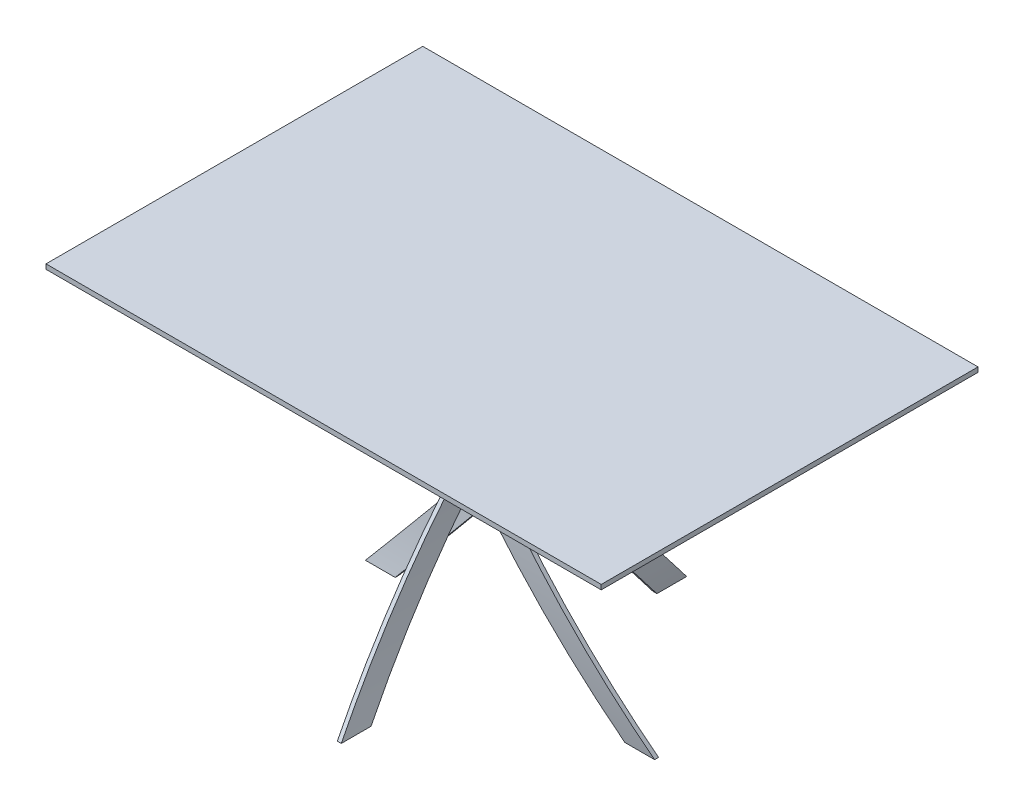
ISO-10303-21;
HEADER;
FILE_DESCRIPTION(('STEP AP214'),'2;1');
FILE_NAME('part.step','',(''),(''),'','','');
FILE_SCHEMA(('AUTOMOTIVE_DESIGN { 1 0 10303 214 1 1 1 1 }'));
ENDSEC;
DATA;
#1=APPLICATION_CONTEXT('core data for automotive mechanical design processes');
#2=APPLICATION_PROTOCOL_DEFINITION('international standard','automotive_design',2000,#1);
#3=PRODUCT_CONTEXT('',#1,'mechanical');
#4=PRODUCT('Part','Part','',(#3));
#5=PRODUCT_RELATED_PRODUCT_CATEGORY('part','',(#4));
#6=PRODUCT_DEFINITION_FORMATION('','',#4);
#7=PRODUCT_DEFINITION_CONTEXT('part definition',#1,'design');
#8=PRODUCT_DEFINITION('design','',#6,#7);
#9=PRODUCT_DEFINITION_SHAPE('','',#8);
#10=(LENGTH_UNIT() NAMED_UNIT(*) SI_UNIT(.MILLI.,.METRE.));
#11=(NAMED_UNIT(*) PLANE_ANGLE_UNIT() SI_UNIT($,.RADIAN.));
#12=(NAMED_UNIT(*) SI_UNIT($,.STERADIAN.) SOLID_ANGLE_UNIT());
#13=UNCERTAINTY_MEASURE_WITH_UNIT(LENGTH_MEASURE(1.E-05),#10,'distance_accuracy_value','');
#14=(GEOMETRIC_REPRESENTATION_CONTEXT(3) GLOBAL_UNCERTAINTY_ASSIGNED_CONTEXT((#13)) GLOBAL_UNIT_ASSIGNED_CONTEXT((#10,
#11,#12)) REPRESENTATION_CONTEXT('',''));
#15=CARTESIAN_POINT('',(0.,0.,0.));
#16=DIRECTION('',(0.,0.,1.));
#17=DIRECTION('',(1.,0.,0.));
#18=AXIS2_PLACEMENT_3D('',#15,#16,#17);
#19=CARTESIAN_POINT('',(1721.56180703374,370.,500.000000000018));
#20=DIRECTION('',(0.,0.,-1.));
#21=DIRECTION('',(-1.,0.,0.));
#22=AXIS2_PLACEMENT_3D('',#19,#20,#21);
#23=CYLINDRICAL_SURFACE('',#22,1800.);
#24=DIRECTION('',(0.,0.,-1.));
#25=VECTOR('',#24,1.);
#26=CARTESIAN_POINT('',(-40.4188966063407,1.99999999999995,499.999999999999));
#27=LINE('',#26,#25);
#28=CARTESIAN_POINT('',(-40.4188966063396,1.99999999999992,399.994999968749));
#29=VERTEX_POINT('',#28);
#30=CARTESIAN_POINT('',(-40.418896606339,1.99999999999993,324.994999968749));
#31=VERTEX_POINT('',#30);
#32=EDGE_CURVE('E70',#29,#31,#27,.T.);
#33=ORIENTED_EDGE('',*,*,#32,.F.);
#34=CARTESIAN_POINT('',(1721.56180703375,370.,100.808008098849));
#35=DIRECTION('',(0.,0.63083008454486,0.775921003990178));
#36=DIRECTION('',(0.,0.775921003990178,-0.63083008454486));
#37=AXIS2_PLACEMENT_3D('',#34,#35,#36);
#38=ELLIPSE('',#37,2319.82378456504,1800.);
#39=CARTESIAN_POINT('',(-39.9999999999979,740.,-200.005000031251));
#40=VERTEX_POINT('',#39);
#41=EDGE_CURVE('E90',#40,#29,#38,.T.);
#42=ORIENTED_EDGE('',*,*,#41,.F.);
#43=CARTESIAN_POINT('',(1721.56180703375,370.,-200.005000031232));
#44=DIRECTION('',(0.,0.,-1.));
#45=DIRECTION('',(-1.,0.,0.));
#46=AXIS2_PLACEMENT_3D('',#43,#44,#45);
#47=CIRCLE('',#46,1800.);
#48=CARTESIAN_POINT('',(-56.8799090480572,647.75,-200.005000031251));
#49=VERTEX_POINT('',#48);
#50=EDGE_CURVE('E87',#49,#40,#47,.T.);
#51=ORIENTED_EDGE('',*,*,#50,.F.);
#52=CARTESIAN_POINT('',(1721.56180703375,370.,25.808008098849));
#53=DIRECTION('',(0.,-0.63083008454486,-0.775921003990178));
#54=DIRECTION('',(0.,0.775921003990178,-0.63083008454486));
#55=AXIS2_PLACEMENT_3D('',#52,#53,#54);
#56=ELLIPSE('',#55,2319.82378456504,1800.);
#57=EDGE_CURVE('E50',#31,#49,#56,.T.);
#58=ORIENTED_EDGE('',*,*,#57,.F.);
#59=EDGE_LOOP('',(#33,#42,#51,#58));
#60=FACE_BOUND('',#59,.T.);
#61=ADVANCED_FACE('F46',(#60),#23,.T.);
#62=CARTESIAN_POINT('',(-300.000000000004,1.99999999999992,399.994999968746));
#63=DIRECTION('',(0.,0.63083008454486,0.775921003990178));
#64=DIRECTION('',(0.,-0.775921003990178,0.63083008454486));
#65=AXIS2_PLACEMENT_3D('',#62,#63,#64);
#66=PLANE('',#65);
#67=DIRECTION('',(1.,0.,0.));
#68=VECTOR('',#67,1.);
#69=CARTESIAN_POINT('',(-299.999999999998,740.,-200.005000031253));
#70=LINE('',#69,#68);
#71=CARTESIAN_POINT('',(-29.9999999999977,740.,-200.005000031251));
#72=VERTEX_POINT('',#71);
#73=EDGE_CURVE('E110',#40,#72,#70,.T.);
#74=ORIENTED_EDGE('',*,*,#73,.F.);
#75=ORIENTED_EDGE('',*,*,#41,.T.);
#76=DIRECTION('',(1.,0.,0.));
#77=VECTOR('',#76,1.);
#78=CARTESIAN_POINT('',(-300.000000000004,1.99999999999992,399.994999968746));
#79=LINE('',#78,#77);
#80=CARTESIAN_POINT('',(-30.4188966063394,1.99999999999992,399.994999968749));
#81=VERTEX_POINT('',#80);
#82=EDGE_CURVE('E104',#29,#81,#79,.T.);
#83=ORIENTED_EDGE('',*,*,#82,.T.);
#84=CARTESIAN_POINT('',(1731.56180703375,370.,100.808008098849));
#85=DIRECTION('',(0.,0.63083008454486,0.775921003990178));
#86=DIRECTION('',(0.,0.775921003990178,-0.63083008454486));
#87=AXIS2_PLACEMENT_3D('',#84,#85,#86);
#88=ELLIPSE('',#87,2319.82378456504,1800.);
#89=EDGE_CURVE('E95',#81,#72,#88,.F.);
#90=ORIENTED_EDGE('',*,*,#89,.T.);
#91=EDGE_LOOP('',(#74,#75,#83,#90));
#92=FACE_BOUND('',#91,.T.);
#93=ADVANCED_FACE('F119',(#92),#66,.T.);
#94=CARTESIAN_POINT('',(-299.999999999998,647.75,-200.005000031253));
#95=DIRECTION('',(0.,-0.63083008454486,-0.775921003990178));
#96=DIRECTION('',(0.,0.775921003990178,-0.63083008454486));
#97=AXIS2_PLACEMENT_3D('',#94,#95,#96);
#98=PLANE('',#97);
#99=DIRECTION('',(1.,0.,0.));
#100=VECTOR('',#99,1.);
#101=CARTESIAN_POINT('',(-300.000000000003,1.99999999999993,324.994999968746));
#102=LINE('',#101,#100);
#103=CARTESIAN_POINT('',(-30.4188966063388,1.99999999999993,324.994999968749));
#104=VERTEX_POINT('',#103);
#105=EDGE_CURVE('E12',#31,#104,#102,.T.);
#106=ORIENTED_EDGE('',*,*,#105,.F.);
#107=ORIENTED_EDGE('',*,*,#57,.T.);
#108=DIRECTION('',(1.,0.,0.));
#109=VECTOR('',#108,1.);
#110=CARTESIAN_POINT('',(-299.999999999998,647.75,-200.005000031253));
#111=LINE('',#110,#109);
#112=CARTESIAN_POINT('',(-46.879909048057,647.75,-200.005000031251));
#113=VERTEX_POINT('',#112);
#114=EDGE_CURVE('E55',#49,#113,#111,.T.);
#115=ORIENTED_EDGE('',*,*,#114,.T.);
#116=CARTESIAN_POINT('',(1731.56180703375,370.,25.8080080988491));
#117=DIRECTION('',(0.,-0.63083008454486,-0.775921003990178));
#118=DIRECTION('',(0.,0.775921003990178,-0.63083008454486));
#119=AXIS2_PLACEMENT_3D('',#116,#117,#118);
#120=ELLIPSE('',#119,2319.82378456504,1800.);
#121=EDGE_CURVE('E100',#113,#104,#120,.F.);
#122=ORIENTED_EDGE('',*,*,#121,.T.);
#123=EDGE_LOOP('',(#106,#107,#115,#122));
#124=FACE_BOUND('',#123,.T.);
#125=ADVANCED_FACE('F48',(#124),#98,.T.);
#126=CARTESIAN_POINT('',(-300.000000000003,1.99999999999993,324.994999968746));
#127=DIRECTION('',(0.,-1.,0.));
#128=DIRECTION('',(0.,0.,-1.));
#129=AXIS2_PLACEMENT_3D('',#126,#127,#128);
#130=PLANE('',#129);
#131=ORIENTED_EDGE('',*,*,#82,.F.);
#132=ORIENTED_EDGE('',*,*,#32,.T.);
#133=ORIENTED_EDGE('',*,*,#105,.T.);
#134=DIRECTION('',(0.,0.,-1.));
#135=VECTOR('',#134,1.);
#136=CARTESIAN_POINT('',(-30.4188966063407,1.99999999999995,500.));
#137=LINE('',#136,#135);
#138=EDGE_CURVE('E62',#104,#81,#137,.F.);
#139=ORIENTED_EDGE('',*,*,#138,.T.);
#140=EDGE_LOOP('',(#131,#132,#133,#139));
#141=FACE_BOUND('',#140,.T.);
#142=ADVANCED_FACE('F118',(#141),#130,.T.);
#143=CARTESIAN_POINT('',(-299.999999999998,740.,-200.005000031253));
#144=DIRECTION('',(0.,0.,-1.));
#145=DIRECTION('',(-1.,0.,0.));
#146=AXIS2_PLACEMENT_3D('',#143,#144,#145);
#147=PLANE('',#146);
#148=ORIENTED_EDGE('',*,*,#114,.F.);
#149=ORIENTED_EDGE('',*,*,#50,.T.);
#150=ORIENTED_EDGE('',*,*,#73,.T.);
#151=CARTESIAN_POINT('',(1731.56180703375,370.,-200.005000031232));
#152=DIRECTION('',(0.,0.,-1.));
#153=DIRECTION('',(-1.,0.,0.));
#154=AXIS2_PLACEMENT_3D('',#151,#152,#153);
#155=CIRCLE('',#154,1800.);
#156=EDGE_CURVE('E96',#72,#113,#155,.F.);
#157=ORIENTED_EDGE('',*,*,#156,.T.);
#158=EDGE_LOOP('',(#148,#149,#150,#157));
#159=FACE_BOUND('',#158,.T.);
#160=ADVANCED_FACE('F101',(#159),#147,.T.);
#161=CARTESIAN_POINT('',(1731.56180703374,370.,500.000000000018));
#162=DIRECTION('',(0.,0.,-1.));
#163=DIRECTION('',(-1.,0.,0.));
#164=AXIS2_PLACEMENT_3D('',#161,#162,#163);
#165=CYLINDRICAL_SURFACE('',#164,1800.);
#166=ORIENTED_EDGE('',*,*,#138,.F.);
#167=ORIENTED_EDGE('',*,*,#121,.F.);
#168=ORIENTED_EDGE('',*,*,#156,.F.);
#169=ORIENTED_EDGE('',*,*,#89,.F.);
#170=EDGE_LOOP('',(#166,#167,#168,#169));
#171=FACE_BOUND('',#170,.T.);
#172=ADVANCED_FACE('F122',(#171),#165,.F.);
#173=CLOSED_SHELL('',(#61,#93,#125,#142,#160,#172));
#174=MANIFOLD_SOLID_BREP('B2',#173);
#175=CARTESIAN_POINT('',(500.,370.,-1721.56180703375));
#176=DIRECTION('',(-1.,0.,0.));
#177=DIRECTION('',(0.,0.,1.));
#178=AXIS2_PLACEMENT_3D('',#175,#176,#177);
#179=CYLINDRICAL_SURFACE('',#178,1800.);
#180=DIRECTION('',(-1.,0.,0.));
#181=VECTOR('',#180,1.);
#182=CARTESIAN_POINT('',(500.,1.99999999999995,40.4188966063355));
#183=LINE('',#182,#181);
#184=CARTESIAN_POINT('',(399.99499996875,1.99999999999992,40.4188966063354));
#185=VERTEX_POINT('',#184);
#186=CARTESIAN_POINT('',(324.99499996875,1.99999999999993,40.4188966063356));
#187=VERTEX_POINT('',#186);
#188=EDGE_CURVE('E216',#185,#187,#183,.T.);
#189=ORIENTED_EDGE('',*,*,#188,.F.);
#190=CARTESIAN_POINT('',(100.808008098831,370.,-1721.56180703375));
#191=DIRECTION('',(0.775921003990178,0.63083008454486,0.));
#192=DIRECTION('',(-0.63083008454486,0.775921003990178,0.));
#193=AXIS2_PLACEMENT_3D('',#190,#191,#192);
#194=ELLIPSE('',#193,2319.82378456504,1800.);
#195=CARTESIAN_POINT('',(-200.00500003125,740.,40.));
#196=VERTEX_POINT('',#195);
#197=EDGE_CURVE('E236',#196,#185,#194,.T.);
#198=ORIENTED_EDGE('',*,*,#197,.F.);
#199=CARTESIAN_POINT('',(-200.00500003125,370.,-1721.56180703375));
#200=DIRECTION('',(-1.,0.,0.));
#201=DIRECTION('',(0.,0.,1.));
#202=AXIS2_PLACEMENT_3D('',#199,#200,#201);
#203=CIRCLE('',#202,1800.);
#204=CARTESIAN_POINT('',(-200.00500003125,647.75,56.8799090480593));
#205=VERTEX_POINT('',#204);
#206=EDGE_CURVE('E233',#205,#196,#203,.T.);
#207=ORIENTED_EDGE('',*,*,#206,.F.);
#208=CARTESIAN_POINT('',(25.808008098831,370.,-1721.56180703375));
#209=DIRECTION('',(-0.775921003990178,-0.63083008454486,0.));
#210=DIRECTION('',(-0.63083008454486,0.775921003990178,0.));
#211=AXIS2_PLACEMENT_3D('',#208,#209,#210);
#212=ELLIPSE('',#211,2319.82378456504,1800.);
#213=EDGE_CURVE('E196',#187,#205,#212,.T.);
#214=ORIENTED_EDGE('',*,*,#213,.F.);
#215=EDGE_LOOP('',(#189,#198,#207,#214));
#216=FACE_BOUND('',#215,.T.);
#217=ADVANCED_FACE('F192',(#216),#179,.T.);
#218=CARTESIAN_POINT('',(399.99499996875,1.99999999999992,300.));
#219=DIRECTION('',(0.775921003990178,0.63083008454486,0.));
#220=DIRECTION('',(0.63083008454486,-0.775921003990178,0.));
#221=AXIS2_PLACEMENT_3D('',#218,#219,#220);
#222=PLANE('',#221);
#223=DIRECTION('',(0.,0.,-1.));
#224=VECTOR('',#223,1.);
#225=CARTESIAN_POINT('',(-200.00500003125,740.,300.));
#226=LINE('',#225,#224);
#227=CARTESIAN_POINT('',(-200.00500003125,740.,29.9999999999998));
#228=VERTEX_POINT('',#227);
#229=EDGE_CURVE('E256',#196,#228,#226,.T.);
#230=ORIENTED_EDGE('',*,*,#229,.F.);
#231=ORIENTED_EDGE('',*,*,#197,.T.);
#232=DIRECTION('',(0.,0.,-1.));
#233=VECTOR('',#232,1.);
#234=CARTESIAN_POINT('',(399.99499996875,1.99999999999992,300.));
#235=LINE('',#234,#233);
#236=CARTESIAN_POINT('',(399.99499996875,1.99999999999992,30.4188966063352));
#237=VERTEX_POINT('',#236);
#238=EDGE_CURVE('E250',#185,#237,#235,.T.);
#239=ORIENTED_EDGE('',*,*,#238,.T.);
#240=CARTESIAN_POINT('',(100.808008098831,370.,-1731.56180703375));
#241=DIRECTION('',(0.775921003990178,0.63083008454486,0.));
#242=DIRECTION('',(-0.63083008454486,0.775921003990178,0.));
#243=AXIS2_PLACEMENT_3D('',#240,#241,#242);
#244=ELLIPSE('',#243,2319.82378456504,1800.);
#245=EDGE_CURVE('E241',#237,#228,#244,.F.);
#246=ORIENTED_EDGE('',*,*,#245,.T.);
#247=EDGE_LOOP('',(#230,#231,#239,#246));
#248=FACE_BOUND('',#247,.T.);
#249=ADVANCED_FACE('F265',(#248),#222,.T.);
#250=CARTESIAN_POINT('',(-200.00500003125,647.75,300.));
#251=DIRECTION('',(-0.775921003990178,-0.63083008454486,0.));
#252=DIRECTION('',(-0.63083008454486,0.775921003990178,0.));
#253=AXIS2_PLACEMENT_3D('',#250,#251,#252);
#254=PLANE('',#253);
#255=DIRECTION('',(0.,0.,-1.));
#256=VECTOR('',#255,1.);
#257=CARTESIAN_POINT('',(324.99499996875,1.99999999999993,300.));
#258=LINE('',#257,#256);
#259=CARTESIAN_POINT('',(324.99499996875,1.99999999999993,30.4188966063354));
#260=VERTEX_POINT('',#259);
#261=EDGE_CURVE('E44',#187,#260,#258,.T.);
#262=ORIENTED_EDGE('',*,*,#261,.F.);
#263=ORIENTED_EDGE('',*,*,#213,.T.);
#264=DIRECTION('',(0.,0.,-1.));
#265=VECTOR('',#264,1.);
#266=CARTESIAN_POINT('',(-200.00500003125,647.75,300.));
#267=LINE('',#266,#265);
#268=CARTESIAN_POINT('',(-200.00500003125,647.75,46.8799090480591));
#269=VERTEX_POINT('',#268);
#270=EDGE_CURVE('E201',#205,#269,#267,.T.);
#271=ORIENTED_EDGE('',*,*,#270,.T.);
#272=CARTESIAN_POINT('',(25.808008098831,370.,-1731.56180703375));
#273=DIRECTION('',(-0.775921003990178,-0.63083008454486,0.));
#274=DIRECTION('',(-0.63083008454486,0.775921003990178,0.));
#275=AXIS2_PLACEMENT_3D('',#272,#273,#274);
#276=ELLIPSE('',#275,2319.82378456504,1800.);
#277=EDGE_CURVE('E246',#269,#260,#276,.F.);
#278=ORIENTED_EDGE('',*,*,#277,.T.);
#279=EDGE_LOOP('',(#262,#263,#271,#278));
#280=FACE_BOUND('',#279,.T.);
#281=ADVANCED_FACE('F194',(#280),#254,.T.);
#282=CARTESIAN_POINT('',(324.99499996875,1.99999999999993,300.));
#283=DIRECTION('',(0.,-1.,0.));
#284=DIRECTION('',(-1.,0.,0.));
#285=AXIS2_PLACEMENT_3D('',#282,#283,#284);
#286=PLANE('',#285);
#287=ORIENTED_EDGE('',*,*,#238,.F.);
#288=ORIENTED_EDGE('',*,*,#188,.T.);
#289=ORIENTED_EDGE('',*,*,#261,.T.);
#290=DIRECTION('',(-1.,0.,0.));
#291=VECTOR('',#290,1.);
#292=CARTESIAN_POINT('',(500.,1.99999999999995,30.4188966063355));
#293=LINE('',#292,#291);
#294=EDGE_CURVE('E208',#260,#237,#293,.F.);
#295=ORIENTED_EDGE('',*,*,#294,.T.);
#296=EDGE_LOOP('',(#287,#288,#289,#295));
#297=FACE_BOUND('',#296,.T.);
#298=ADVANCED_FACE('F264',(#297),#286,.T.);
#299=CARTESIAN_POINT('',(-200.00500003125,740.,300.));
#300=DIRECTION('',(-1.,0.,0.));
#301=DIRECTION('',(0.,0.,1.));
#302=AXIS2_PLACEMENT_3D('',#299,#300,#301);
#303=PLANE('',#302);
#304=ORIENTED_EDGE('',*,*,#270,.F.);
#305=ORIENTED_EDGE('',*,*,#206,.T.);
#306=ORIENTED_EDGE('',*,*,#229,.T.);
#307=CARTESIAN_POINT('',(-200.00500003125,370.,-1731.56180703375));
#308=DIRECTION('',(-1.,0.,0.));
#309=DIRECTION('',(0.,0.,1.));
#310=AXIS2_PLACEMENT_3D('',#307,#308,#309);
#311=CIRCLE('',#310,1800.);
#312=EDGE_CURVE('E242',#228,#269,#311,.F.);
#313=ORIENTED_EDGE('',*,*,#312,.T.);
#314=EDGE_LOOP('',(#304,#305,#306,#313));
#315=FACE_BOUND('',#314,.T.);
#316=ADVANCED_FACE('F247',(#315),#303,.T.);
#317=CARTESIAN_POINT('',(500.,370.,-1731.56180703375));
#318=DIRECTION('',(-1.,0.,0.));
#319=DIRECTION('',(0.,0.,1.));
#320=AXIS2_PLACEMENT_3D('',#317,#318,#319);
#321=CYLINDRICAL_SURFACE('',#320,1800.);
#322=ORIENTED_EDGE('',*,*,#294,.F.);
#323=ORIENTED_EDGE('',*,*,#277,.F.);
#324=ORIENTED_EDGE('',*,*,#312,.F.);
#325=ORIENTED_EDGE('',*,*,#245,.F.);
#326=EDGE_LOOP('',(#322,#323,#324,#325));
#327=FACE_BOUND('',#326,.T.);
#328=ADVANCED_FACE('F268',(#327),#321,.F.);
#329=CLOSED_SHELL('',(#217,#249,#281,#298,#316,#328));
#330=MANIFOLD_SOLID_BREP('B6',#329);
#331=CARTESIAN_POINT('',(-1721.56180703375,370.,-500.000000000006));
#332=DIRECTION('',(0.,0.,1.));
#333=DIRECTION('',(1.,0.,0.));
#334=AXIS2_PLACEMENT_3D('',#331,#332,#333);
#335=CYLINDRICAL_SURFACE('',#334,1800.);
#336=DIRECTION('',(0.,0.,1.));
#337=VECTOR('',#336,1.);
#338=CARTESIAN_POINT('',(40.4188966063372,1.99999999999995,-500.));
#339=LINE('',#338,#337);
#340=CARTESIAN_POINT('',(40.4188966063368,1.99999999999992,-399.994999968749));
#341=VERTEX_POINT('',#340);
#342=CARTESIAN_POINT('',(40.4188966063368,1.99999999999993,-324.994999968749));
#343=VERTEX_POINT('',#342);
#344=EDGE_CURVE('E362',#341,#343,#339,.T.);
#345=ORIENTED_EDGE('',*,*,#344,.F.);
#346=CARTESIAN_POINT('',(-1721.56180703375,370.,-100.808008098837));
#347=DIRECTION('',(0.,0.63083008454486,-0.775921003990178));
#348=DIRECTION('',(0.,0.775921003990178,0.63083008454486));
#349=AXIS2_PLACEMENT_3D('',#346,#347,#348);
#350=ELLIPSE('',#349,2319.82378456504,1800.);
#351=CARTESIAN_POINT('',(39.9999999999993,740.,200.00500003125));
#352=VERTEX_POINT('',#351);
#353=EDGE_CURVE('E382',#352,#341,#350,.T.);
#354=ORIENTED_EDGE('',*,*,#353,.F.);
#355=CARTESIAN_POINT('',(-1721.56180703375,370.,200.005000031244));
#356=DIRECTION('',(0.,0.,1.));
#357=DIRECTION('',(1.,0.,0.));
#358=AXIS2_PLACEMENT_3D('',#355,#356,#357);
#359=CIRCLE('',#358,1800.);
#360=CARTESIAN_POINT('',(56.8799090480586,647.75,200.00500003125));
#361=VERTEX_POINT('',#360);
#362=EDGE_CURVE('E379',#361,#352,#359,.T.);
#363=ORIENTED_EDGE('',*,*,#362,.F.);
#364=CARTESIAN_POINT('',(-1721.56180703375,370.,-25.808008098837));
#365=DIRECTION('',(0.,-0.63083008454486,0.775921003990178));
#366=DIRECTION('',(0.,0.775921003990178,0.63083008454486));
#367=AXIS2_PLACEMENT_3D('',#364,#365,#366);
#368=ELLIPSE('',#367,2319.82378456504,1800.);
#369=EDGE_CURVE('E342',#343,#361,#368,.T.);
#370=ORIENTED_EDGE('',*,*,#369,.F.);
#371=EDGE_LOOP('',(#345,#354,#363,#370));
#372=FACE_BOUND('',#371,.T.);
#373=ADVANCED_FACE('F338',(#372),#335,.T.);
#374=CARTESIAN_POINT('',(300.000000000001,1.99999999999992,-399.994999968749));
#375=DIRECTION('',(0.,0.63083008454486,-0.775921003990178));
#376=DIRECTION('',(0.,-0.775921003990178,-0.63083008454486));
#377=AXIS2_PLACEMENT_3D('',#374,#375,#376);
#378=PLANE('',#377);
#379=DIRECTION('',(-1.,0.,0.));
#380=VECTOR('',#379,1.);
#381=CARTESIAN_POINT('',(299.999999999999,740.,200.005000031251));
#382=LINE('',#381,#380);
#383=CARTESIAN_POINT('',(29.9999999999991,740.,200.00500003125));
#384=VERTEX_POINT('',#383);
#385=EDGE_CURVE('E402',#352,#384,#382,.T.);
#386=ORIENTED_EDGE('',*,*,#385,.F.);
#387=ORIENTED_EDGE('',*,*,#353,.T.);
#388=DIRECTION('',(-1.,0.,0.));
#389=VECTOR('',#388,1.);
#390=CARTESIAN_POINT('',(300.000000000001,1.99999999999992,-399.994999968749));
#391=LINE('',#390,#389);
#392=CARTESIAN_POINT('',(30.4188966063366,1.99999999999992,-399.99499996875));
#393=VERTEX_POINT('',#392);
#394=EDGE_CURVE('E396',#341,#393,#391,.T.);
#395=ORIENTED_EDGE('',*,*,#394,.T.);
#396=CARTESIAN_POINT('',(-1731.56180703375,370.,-100.808008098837));
#397=DIRECTION('',(0.,0.63083008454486,-0.775921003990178));
#398=DIRECTION('',(0.,0.775921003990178,0.63083008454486));
#399=AXIS2_PLACEMENT_3D('',#396,#397,#398);
#400=ELLIPSE('',#399,2319.82378456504,1800.);
#401=EDGE_CURVE('E387',#393,#384,#400,.F.);
#402=ORIENTED_EDGE('',*,*,#401,.T.);
#403=EDGE_LOOP('',(#386,#387,#395,#402));
#404=FACE_BOUND('',#403,.T.);
#405=ADVANCED_FACE('F411',(#404),#378,.T.);
#406=CARTESIAN_POINT('',(299.999999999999,647.75,200.005000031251));
#407=DIRECTION('',(0.,-0.63083008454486,0.775921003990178));
#408=DIRECTION('',(0.,0.775921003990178,0.63083008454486));
#409=AXIS2_PLACEMENT_3D('',#406,#407,#408);
#410=PLANE('',#409);
#411=DIRECTION('',(-1.,0.,0.));
#412=VECTOR('',#411,1.);
#413=CARTESIAN_POINT('',(300.000000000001,1.99999999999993,-324.994999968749));
#414=LINE('',#413,#412);
#415=CARTESIAN_POINT('',(30.4188966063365,1.99999999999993,-324.99499996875));
#416=VERTEX_POINT('',#415);
#417=EDGE_CURVE('E190',#343,#416,#414,.T.);
#418=ORIENTED_EDGE('',*,*,#417,.F.);
#419=ORIENTED_EDGE('',*,*,#369,.T.);
#420=DIRECTION('',(-1.,0.,0.));
#421=VECTOR('',#420,1.);
#422=CARTESIAN_POINT('',(299.999999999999,647.75,200.005000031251));
#423=LINE('',#422,#421);
#424=CARTESIAN_POINT('',(46.8799090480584,647.75,200.00500003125));
#425=VERTEX_POINT('',#424);
#426=EDGE_CURVE('E347',#361,#425,#423,.T.);
#427=ORIENTED_EDGE('',*,*,#426,.T.);
#428=CARTESIAN_POINT('',(-1731.56180703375,370.,-25.808008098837));
#429=DIRECTION('',(0.,-0.63083008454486,0.775921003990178));
#430=DIRECTION('',(0.,0.775921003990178,0.63083008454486));
#431=AXIS2_PLACEMENT_3D('',#428,#429,#430);
#432=ELLIPSE('',#431,2319.82378456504,1800.);
#433=EDGE_CURVE('E392',#425,#416,#432,.F.);
#434=ORIENTED_EDGE('',*,*,#433,.T.);
#435=EDGE_LOOP('',(#418,#419,#427,#434));
#436=FACE_BOUND('',#435,.T.);
#437=ADVANCED_FACE('F340',(#436),#410,.T.);
#438=CARTESIAN_POINT('',(300.000000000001,1.99999999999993,-324.994999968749));
#439=DIRECTION('',(0.,-1.,0.));
#440=DIRECTION('',(0.,0.,1.));
#441=AXIS2_PLACEMENT_3D('',#438,#439,#440);
#442=PLANE('',#441);
#443=ORIENTED_EDGE('',*,*,#394,.F.);
#444=ORIENTED_EDGE('',*,*,#344,.T.);
#445=ORIENTED_EDGE('',*,*,#417,.T.);
#446=DIRECTION('',(0.,0.,1.));
#447=VECTOR('',#446,1.);
#448=CARTESIAN_POINT('',(30.4188966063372,1.99999999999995,-500.));
#449=LINE('',#448,#447);
#450=EDGE_CURVE('E354',#416,#393,#449,.F.);
#451=ORIENTED_EDGE('',*,*,#450,.T.);
#452=EDGE_LOOP('',(#443,#444,#445,#451));
#453=FACE_BOUND('',#452,.T.);
#454=ADVANCED_FACE('F410',(#453),#442,.T.);
#455=CARTESIAN_POINT('',(299.999999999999,740.,200.005000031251));
#456=DIRECTION('',(0.,0.,1.));
#457=DIRECTION('',(1.,0.,0.));
#458=AXIS2_PLACEMENT_3D('',#455,#456,#457);
#459=PLANE('',#458);
#460=ORIENTED_EDGE('',*,*,#426,.F.);
#461=ORIENTED_EDGE('',*,*,#362,.T.);
#462=ORIENTED_EDGE('',*,*,#385,.T.);
#463=CARTESIAN_POINT('',(-1731.56180703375,370.,200.005000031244));
#464=DIRECTION('',(0.,0.,1.));
#465=DIRECTION('',(1.,0.,0.));
#466=AXIS2_PLACEMENT_3D('',#463,#464,#465);
#467=CIRCLE('',#466,1800.);
#468=EDGE_CURVE('E388',#384,#425,#467,.F.);
#469=ORIENTED_EDGE('',*,*,#468,.T.);
#470=EDGE_LOOP('',(#460,#461,#462,#469));
#471=FACE_BOUND('',#470,.T.);
#472=ADVANCED_FACE('F393',(#471),#459,.T.);
#473=CARTESIAN_POINT('',(-1731.56180703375,370.,-500.000000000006));
#474=DIRECTION('',(0.,0.,1.));
#475=DIRECTION('',(1.,0.,0.));
#476=AXIS2_PLACEMENT_3D('',#473,#474,#475);
#477=CYLINDRICAL_SURFACE('',#476,1800.);
#478=ORIENTED_EDGE('',*,*,#450,.F.);
#479=ORIENTED_EDGE('',*,*,#433,.F.);
#480=ORIENTED_EDGE('',*,*,#468,.F.);
#481=ORIENTED_EDGE('',*,*,#401,.F.);
#482=EDGE_LOOP('',(#478,#479,#480,#481));
#483=FACE_BOUND('',#482,.T.);
#484=ADVANCED_FACE('F414',(#483),#477,.F.);
#485=CLOSED_SHELL('',(#373,#405,#437,#454,#472,#484));
#486=MANIFOLD_SOLID_BREP('B38',#485);
#487=CARTESIAN_POINT('',(-500.,370.,1721.56180703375));
#488=DIRECTION('',(1.,0.,0.));
#489=DIRECTION('',(0.,0.,-1.));
#490=AXIS2_PLACEMENT_3D('',#487,#488,#489);
#491=CYLINDRICAL_SURFACE('',#490,1800.);
#492=DIRECTION('',(1.,0.,0.));
#493=VECTOR('',#492,1.);
#494=CARTESIAN_POINT('',(-500.,1.99999999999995,-40.4188966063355));
#495=LINE('',#494,#493);
#496=CARTESIAN_POINT('',(-399.99499996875,1.99999999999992,-40.4188966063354));
#497=VERTEX_POINT('',#496);
#498=CARTESIAN_POINT('',(-324.99499996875,1.99999999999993,-40.4188966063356));
#499=VERTEX_POINT('',#498);
#500=EDGE_CURVE('E507',#497,#499,#495,.T.);
#501=ORIENTED_EDGE('',*,*,#500,.F.);
#502=CARTESIAN_POINT('',(-100.808008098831,370.,1721.56180703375));
#503=DIRECTION('',(-0.775921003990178,0.63083008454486,0.));
#504=DIRECTION('',(0.63083008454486,0.775921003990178,0.));
#505=AXIS2_PLACEMENT_3D('',#502,#503,#504);
#506=ELLIPSE('',#505,2319.82378456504,1800.);
#507=CARTESIAN_POINT('',(200.00500003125,740.,-40.));
#508=VERTEX_POINT('',#507);
#509=EDGE_CURVE('E527',#508,#497,#506,.T.);
#510=ORIENTED_EDGE('',*,*,#509,.F.);
#511=CARTESIAN_POINT('',(200.00500003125,370.,1721.56180703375));
#512=DIRECTION('',(1.,0.,0.));
#513=DIRECTION('',(0.,0.,-1.));
#514=AXIS2_PLACEMENT_3D('',#511,#512,#513);
#515=CIRCLE('',#514,1800.);
#516=CARTESIAN_POINT('',(200.00500003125,647.75,-56.8799090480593));
#517=VERTEX_POINT('',#516);
#518=EDGE_CURVE('E524',#517,#508,#515,.T.);
#519=ORIENTED_EDGE('',*,*,#518,.F.);
#520=CARTESIAN_POINT('',(-25.808008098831,370.,1721.56180703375));
#521=DIRECTION('',(0.775921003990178,-0.63083008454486,0.));
#522=DIRECTION('',(0.63083008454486,0.775921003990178,0.));
#523=AXIS2_PLACEMENT_3D('',#520,#521,#522);
#524=ELLIPSE('',#523,2319.82378456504,1800.);
#525=EDGE_CURVE('E487',#499,#517,#524,.T.);
#526=ORIENTED_EDGE('',*,*,#525,.F.);
#527=EDGE_LOOP('',(#501,#510,#519,#526));
#528=FACE_BOUND('',#527,.T.);
#529=ADVANCED_FACE('F483',(#528),#491,.T.);
#530=CARTESIAN_POINT('',(-399.99499996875,1.99999999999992,-300.));
#531=DIRECTION('',(-0.775921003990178,0.63083008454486,0.));
#532=DIRECTION('',(-0.63083008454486,-0.775921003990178,0.));
#533=AXIS2_PLACEMENT_3D('',#530,#531,#532);
#534=PLANE('',#533);
#535=DIRECTION('',(0.,0.,1.));
#536=VECTOR('',#535,1.);
#537=CARTESIAN_POINT('',(200.00500003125,740.,-300.));
#538=LINE('',#537,#536);
#539=CARTESIAN_POINT('',(200.00500003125,740.,-29.9999999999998));
#540=VERTEX_POINT('',#539);
#541=EDGE_CURVE('E547',#508,#540,#538,.T.);
#542=ORIENTED_EDGE('',*,*,#541,.F.);
#543=ORIENTED_EDGE('',*,*,#509,.T.);
#544=DIRECTION('',(0.,0.,1.));
#545=VECTOR('',#544,1.);
#546=CARTESIAN_POINT('',(-399.99499996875,1.99999999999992,-300.));
#547=LINE('',#546,#545);
#548=CARTESIAN_POINT('',(-399.99499996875,1.99999999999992,-30.4188966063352));
#549=VERTEX_POINT('',#548);
#550=EDGE_CURVE('E541',#497,#549,#547,.T.);
#551=ORIENTED_EDGE('',*,*,#550,.T.);
#552=CARTESIAN_POINT('',(-100.808008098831,370.,1731.56180703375));
#553=DIRECTION('',(-0.775921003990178,0.63083008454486,0.));
#554=DIRECTION('',(0.63083008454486,0.775921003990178,0.));
#555=AXIS2_PLACEMENT_3D('',#552,#553,#554);
#556=ELLIPSE('',#555,2319.82378456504,1800.);
#557=EDGE_CURVE('E532',#549,#540,#556,.F.);
#558=ORIENTED_EDGE('',*,*,#557,.T.);
#559=EDGE_LOOP('',(#542,#543,#551,#558));
#560=FACE_BOUND('',#559,.T.);
#561=ADVANCED_FACE('F556',(#560),#534,.T.);
#562=CARTESIAN_POINT('',(200.00500003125,647.75,-300.));
#563=DIRECTION('',(0.775921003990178,-0.63083008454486,0.));
#564=DIRECTION('',(0.63083008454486,0.775921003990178,0.));
#565=AXIS2_PLACEMENT_3D('',#562,#563,#564);
#566=PLANE('',#565);
#567=DIRECTION('',(0.,0.,1.));
#568=VECTOR('',#567,1.);
#569=CARTESIAN_POINT('',(-324.99499996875,1.99999999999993,-300.));
#570=LINE('',#569,#568);
#571=CARTESIAN_POINT('',(-324.99499996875,1.99999999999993,-30.4188966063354));
#572=VERTEX_POINT('',#571);
#573=EDGE_CURVE('E336',#499,#572,#570,.T.);
#574=ORIENTED_EDGE('',*,*,#573,.F.);
#575=ORIENTED_EDGE('',*,*,#525,.T.);
#576=DIRECTION('',(0.,0.,1.));
#577=VECTOR('',#576,1.);
#578=CARTESIAN_POINT('',(200.00500003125,647.75,-300.));
#579=LINE('',#578,#577);
#580=CARTESIAN_POINT('',(200.00500003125,647.75,-46.8799090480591));
#581=VERTEX_POINT('',#580);
#582=EDGE_CURVE('E492',#517,#581,#579,.T.);
#583=ORIENTED_EDGE('',*,*,#582,.T.);
#584=CARTESIAN_POINT('',(-25.808008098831,370.,1731.56180703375));
#585=DIRECTION('',(0.775921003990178,-0.63083008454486,0.));
#586=DIRECTION('',(0.63083008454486,0.775921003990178,0.));
#587=AXIS2_PLACEMENT_3D('',#584,#585,#586);
#588=ELLIPSE('',#587,2319.82378456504,1800.);
#589=EDGE_CURVE('E537',#581,#572,#588,.F.);
#590=ORIENTED_EDGE('',*,*,#589,.T.);
#591=EDGE_LOOP('',(#574,#575,#583,#590));
#592=FACE_BOUND('',#591,.T.);
#593=ADVANCED_FACE('F485',(#592),#566,.T.);
#594=CARTESIAN_POINT('',(-324.99499996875,1.99999999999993,-300.));
#595=DIRECTION('',(0.,-1.,0.));
#596=DIRECTION('',(1.,0.,0.));
#597=AXIS2_PLACEMENT_3D('',#594,#595,#596);
#598=PLANE('',#597);
#599=ORIENTED_EDGE('',*,*,#550,.F.);
#600=ORIENTED_EDGE('',*,*,#500,.T.);
#601=ORIENTED_EDGE('',*,*,#573,.T.);
#602=DIRECTION('',(1.,0.,0.));
#603=VECTOR('',#602,1.);
#604=CARTESIAN_POINT('',(-500.,1.99999999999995,-30.4188966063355));
#605=LINE('',#604,#603);
#606=EDGE_CURVE('E499',#572,#549,#605,.F.);
#607=ORIENTED_EDGE('',*,*,#606,.T.);
#608=EDGE_LOOP('',(#599,#600,#601,#607));
#609=FACE_BOUND('',#608,.T.);
#610=ADVANCED_FACE('F555',(#609),#598,.T.);
#611=CARTESIAN_POINT('',(200.00500003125,740.,-300.));
#612=DIRECTION('',(1.,0.,0.));
#613=DIRECTION('',(0.,0.,-1.));
#614=AXIS2_PLACEMENT_3D('',#611,#612,#613);
#615=PLANE('',#614);
#616=ORIENTED_EDGE('',*,*,#582,.F.);
#617=ORIENTED_EDGE('',*,*,#518,.T.);
#618=ORIENTED_EDGE('',*,*,#541,.T.);
#619=CARTESIAN_POINT('',(200.00500003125,370.,1731.56180703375));
#620=DIRECTION('',(1.,0.,0.));
#621=DIRECTION('',(0.,0.,-1.));
#622=AXIS2_PLACEMENT_3D('',#619,#620,#621);
#623=CIRCLE('',#622,1800.);
#624=EDGE_CURVE('E533',#540,#581,#623,.F.);
#625=ORIENTED_EDGE('',*,*,#624,.T.);
#626=EDGE_LOOP('',(#616,#617,#618,#625));
#627=FACE_BOUND('',#626,.T.);
#628=ADVANCED_FACE('F538',(#627),#615,.T.);
#629=CARTESIAN_POINT('',(-500.,370.,1731.56180703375));
#630=DIRECTION('',(1.,0.,0.));
#631=DIRECTION('',(0.,0.,-1.));
#632=AXIS2_PLACEMENT_3D('',#629,#630,#631);
#633=CYLINDRICAL_SURFACE('',#632,1800.);
#634=ORIENTED_EDGE('',*,*,#606,.F.);
#635=ORIENTED_EDGE('',*,*,#589,.F.);
#636=ORIENTED_EDGE('',*,*,#624,.F.);
#637=ORIENTED_EDGE('',*,*,#557,.F.);
#638=EDGE_LOOP('',(#634,#635,#636,#637));
#639=FACE_BOUND('',#638,.T.);
#640=ADVANCED_FACE('F559',(#639),#633,.F.);
#641=CLOSED_SHELL('',(#529,#561,#593,#610,#628,#640));
#642=MANIFOLD_SOLID_BREP('B184',#641);
#643=CARTESIAN_POINT('',(700.,752.,-475.));
#644=DIRECTION('',(-1.,0.,0.));
#645=DIRECTION('',(0.,0.,1.));
#646=AXIS2_PLACEMENT_3D('',#643,#644,#645);
#647=PLANE('',#646);
#648=DIRECTION('',(0.,0.,-1.));
#649=VECTOR('',#648,1.);
#650=CARTESIAN_POINT('',(700.,740.,-475.));
#651=LINE('',#650,#649);
#652=CARTESIAN_POINT('',(700.,740.,475.));
#653=VERTEX_POINT('',#652);
#654=CARTESIAN_POINT('',(700.,740.,-475.));
#655=VERTEX_POINT('',#654);
#656=EDGE_CURVE('E670',#653,#655,#651,.T.);
#657=ORIENTED_EDGE('',*,*,#656,.T.);
#658=DIRECTION('',(0.,-1.,0.));
#659=VECTOR('',#658,1.);
#660=CARTESIAN_POINT('',(700.,752.,-475.));
#661=LINE('',#660,#659);
#662=CARTESIAN_POINT('',(700.,752.,-475.));
#663=VERTEX_POINT('',#662);
#664=EDGE_CURVE('E481',#663,#655,#661,.T.);
#665=ORIENTED_EDGE('',*,*,#664,.F.);
#666=DIRECTION('',(0.,0.,-1.));
#667=VECTOR('',#666,1.);
#668=CARTESIAN_POINT('',(700.,752.,-475.));
#669=LINE('',#668,#667);
#670=CARTESIAN_POINT('',(700.,752.,475.));
#671=VERTEX_POINT('',#670);
#672=EDGE_CURVE('E658',#671,#663,#669,.T.);
#673=ORIENTED_EDGE('',*,*,#672,.F.);
#674=DIRECTION('',(0.,-1.,0.));
#675=VECTOR('',#674,1.);
#676=CARTESIAN_POINT('',(700.,752.,475.));
#677=LINE('',#676,#675);
#678=EDGE_CURVE('E666',#671,#653,#677,.T.);
#679=ORIENTED_EDGE('',*,*,#678,.T.);
#680=EDGE_LOOP('',(#657,#665,#673,#679));
#681=FACE_BOUND('',#680,.T.);
#682=ADVANCED_FACE('F607',(#681),#647,.F.);
#683=CARTESIAN_POINT('',(-700.,752.,-475.));
#684=DIRECTION('',(0.,0.,1.));
#685=DIRECTION('',(1.,0.,0.));
#686=AXIS2_PLACEMENT_3D('',#683,#684,#685);
#687=PLANE('',#686);
#688=DIRECTION('',(-1.,0.,0.));
#689=VECTOR('',#688,1.);
#690=CARTESIAN_POINT('',(-700.,740.,-475.));
#691=LINE('',#690,#689);
#692=CARTESIAN_POINT('',(-700.,740.,-475.));
#693=VERTEX_POINT('',#692);
#694=EDGE_CURVE('E662',#655,#693,#691,.T.);
#695=ORIENTED_EDGE('',*,*,#694,.T.);
#696=DIRECTION('',(0.,-1.,0.));
#697=VECTOR('',#696,1.);
#698=CARTESIAN_POINT('',(-700.,752.,-475.));
#699=LINE('',#698,#697);
#700=CARTESIAN_POINT('',(-700.,752.,-475.));
#701=VERTEX_POINT('',#700);
#702=EDGE_CURVE('E615',#701,#693,#699,.T.);
#703=ORIENTED_EDGE('',*,*,#702,.F.);
#704=DIRECTION('',(-1.,0.,0.));
#705=VECTOR('',#704,1.);
#706=CARTESIAN_POINT('',(-700.,752.,-475.));
#707=LINE('',#706,#705);
#708=EDGE_CURVE('E653',#663,#701,#707,.T.);
#709=ORIENTED_EDGE('',*,*,#708,.F.);
#710=ORIENTED_EDGE('',*,*,#664,.T.);
#711=EDGE_LOOP('',(#695,#703,#709,#710));
#712=FACE_BOUND('',#711,.T.);
#713=ADVANCED_FACE('F661',(#712),#687,.F.);
#714=CARTESIAN_POINT('',(-700.,752.,-475.));
#715=DIRECTION('',(1.,0.,0.));
#716=DIRECTION('',(0.,0.,-1.));
#717=AXIS2_PLACEMENT_3D('',#714,#715,#716);
#718=PLANE('',#717);
#719=DIRECTION('',(0.,0.,1.));
#720=VECTOR('',#719,1.);
#721=CARTESIAN_POINT('',(-700.,740.,-475.));
#722=LINE('',#721,#720);
#723=CARTESIAN_POINT('',(-700.,740.,475.));
#724=VERTEX_POINT('',#723);
#725=EDGE_CURVE('E640',#693,#724,#722,.T.);
#726=ORIENTED_EDGE('',*,*,#725,.T.);
#727=DIRECTION('',(0.,-1.,0.));
#728=VECTOR('',#727,1.);
#729=CARTESIAN_POINT('',(-700.,752.,475.));
#730=LINE('',#729,#728);
#731=CARTESIAN_POINT('',(-700.,752.,475.));
#732=VERTEX_POINT('',#731);
#733=EDGE_CURVE('E663',#732,#724,#730,.T.);
#734=ORIENTED_EDGE('',*,*,#733,.F.);
#735=DIRECTION('',(0.,0.,1.));
#736=VECTOR('',#735,1.);
#737=CARTESIAN_POINT('',(-700.,752.,-475.));
#738=LINE('',#737,#736);
#739=EDGE_CURVE('E656',#701,#732,#738,.T.);
#740=ORIENTED_EDGE('',*,*,#739,.F.);
#741=ORIENTED_EDGE('',*,*,#702,.T.);
#742=EDGE_LOOP('',(#726,#734,#740,#741));
#743=FACE_BOUND('',#742,.T.);
#744=ADVANCED_FACE('F664',(#743),#718,.F.);
#745=CARTESIAN_POINT('',(-700.,752.,475.));
#746=DIRECTION('',(0.,0.,-1.));
#747=DIRECTION('',(-1.,0.,0.));
#748=AXIS2_PLACEMENT_3D('',#745,#746,#747);
#749=PLANE('',#748);
#750=DIRECTION('',(1.,0.,0.));
#751=VECTOR('',#750,1.);
#752=CARTESIAN_POINT('',(-700.,740.,475.));
#753=LINE('',#752,#751);
#754=EDGE_CURVE('E646',#724,#653,#753,.T.);
#755=ORIENTED_EDGE('',*,*,#754,.T.);
#756=ORIENTED_EDGE('',*,*,#678,.F.);
#757=DIRECTION('',(1.,0.,0.));
#758=VECTOR('',#757,1.);
#759=CARTESIAN_POINT('',(-700.,752.,475.));
#760=LINE('',#759,#758);
#761=EDGE_CURVE('E623',#732,#671,#760,.T.);
#762=ORIENTED_EDGE('',*,*,#761,.F.);
#763=ORIENTED_EDGE('',*,*,#733,.T.);
#764=EDGE_LOOP('',(#755,#756,#762,#763));
#765=FACE_BOUND('',#764,.T.);
#766=ADVANCED_FACE('F677',(#765),#749,.F.);
#767=CARTESIAN_POINT('',(0.,752.,0.));
#768=DIRECTION('',(0.,1.,0.));
#769=DIRECTION('',(0.,0.,1.));
#770=AXIS2_PLACEMENT_3D('',#767,#768,#769);
#771=PLANE('',#770);
#772=ORIENTED_EDGE('',*,*,#672,.T.);
#773=ORIENTED_EDGE('',*,*,#708,.T.);
#774=ORIENTED_EDGE('',*,*,#739,.T.);
#775=ORIENTED_EDGE('',*,*,#761,.T.);
#776=EDGE_LOOP('',(#772,#773,#774,#775));
#777=FACE_BOUND('',#776,.T.);
#778=ADVANCED_FACE('F654',(#777),#771,.T.);
#779=CARTESIAN_POINT('',(0.,740.,0.));
#780=DIRECTION('',(0.,1.,0.));
#781=DIRECTION('',(0.,0.,1.));
#782=AXIS2_PLACEMENT_3D('',#779,#780,#781);
#783=PLANE('',#782);
#784=ORIENTED_EDGE('',*,*,#656,.F.);
#785=ORIENTED_EDGE('',*,*,#754,.F.);
#786=ORIENTED_EDGE('',*,*,#725,.F.);
#787=ORIENTED_EDGE('',*,*,#694,.F.);
#788=EDGE_LOOP('',(#784,#785,#786,#787));
#789=FACE_BOUND('',#788,.T.);
#790=ADVANCED_FACE('F680',(#789),#783,.F.);
#791=CLOSED_SHELL('',(#682,#713,#744,#766,#778,#790));
#792=MANIFOLD_SOLID_BREP('B330',#791);
#793=ADVANCED_BREP_SHAPE_REPRESENTATION('',(#18,#174,#330,#486,#642,#792),#14);
#794=SHAPE_DEFINITION_REPRESENTATION(#9,#793);
ENDSEC;
END-ISO-10303-21;
